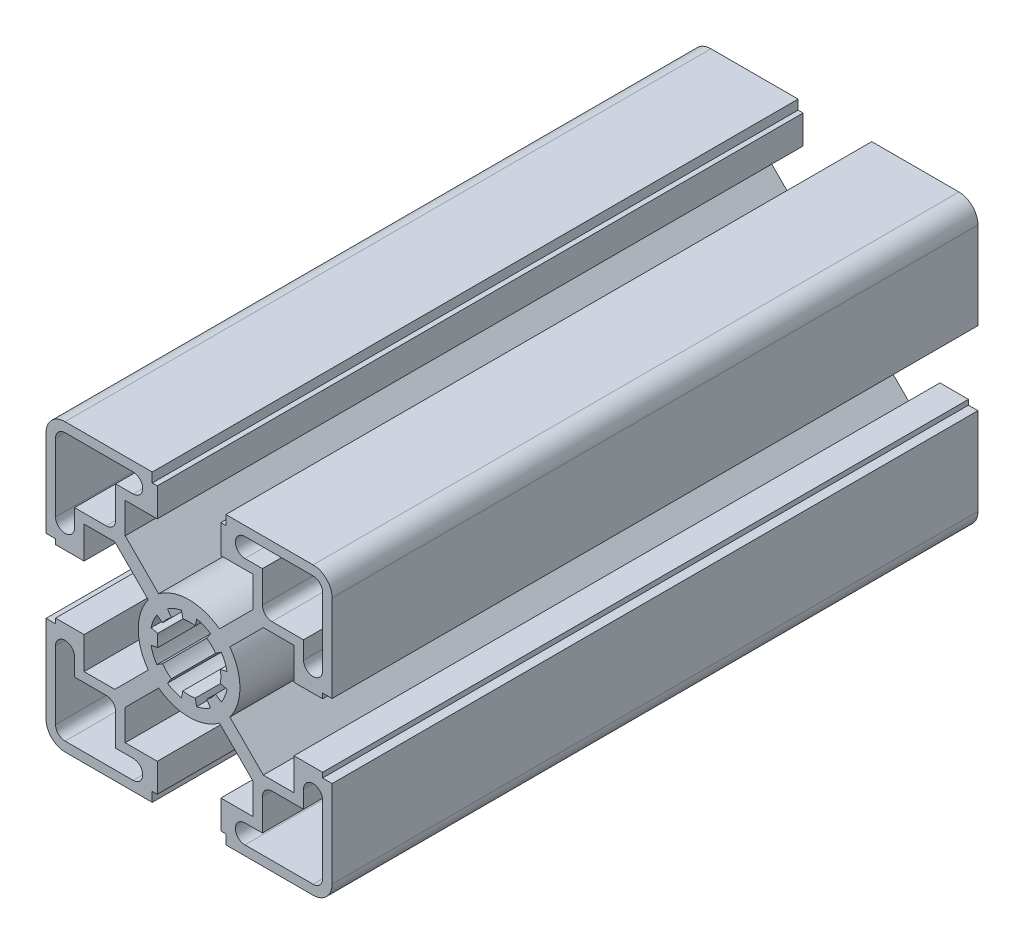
from build123d import *

# Parameters (mm, degrees)
BOSS_EXTRUDE1_DEPTH = 50.8


with BuildPart() as part:
    # Sketch1 → Boss-Extrude1 (new, symmetric)
    with BuildSketch(Plane.XY):
        with BuildLine():
            Line((-19.5072, 22.5044), (-5.7912, 22.5044))
            Line((-5.7912, 22.5044), (-5.7912, 21.0058))
            Line((-5.7912, 21.0058), (-5.0038, 21.0058))
            Line((-5.0038, 21.0058), (-5.0038, 16.51))
            Line((-5.0038, 16.51), (-10.0457, 16.51))
            Line((-10.0457, 16.51), (-10.0457, 11.680106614))
            Line((-10.0457, 11.680106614), (-4.781026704, 6.415433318))
            ThreePointArc((-4.781026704, 6.415433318), (0, 8.001), (4.781026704, 6.415433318))
            Line((4.781026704, 6.415433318), (10.0457, 11.680106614))
            Line((10.0457, 11.680106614), (10.0457, 16.51))
            Line((10.0457, 16.51), (5.0038, 16.51))
            Line((5.0038, 16.51), (5.0038, 21.0058))
            Line((5.0038, 21.0058), (5.7912, 21.0058))
            Line((5.7912, 21.0058), (5.7912, 22.5044))
            Line((5.7912, 22.5044), (19.5072, 22.5044))
            ThreePointArc((19.5072, 22.5044), (21.626540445, 21.626540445), (22.5044, 19.5072))
            Line((22.5044, 19.5072), (22.5044, 5.7912))
            Line((22.5044, 5.7912), (21.0058, 5.7912))
            Line((21.0058, 5.7912), (21.0058, 5.0038))
            Line((21.0058, 5.0038), (16.51, 5.0038))
            Line((16.51, 5.0038), (16.51, 10.0457))
            Line((16.51, 10.0457), (11.680106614, 10.0457))
            Line((11.680106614, 10.0457), (6.415433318, 4.781026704))
            ThreePointArc((6.415433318, 4.781026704), (8.001, 0), (6.415433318, -4.781026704))
            Line((6.415433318, -4.781026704), (11.680106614, -10.0457))
            Line((11.680106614, -10.0457), (16.51, -10.0457))
            Line((16.51, -10.0457), (16.51, -5.0038))
            Line((16.51, -5.0038), (21.0058, -5.0038))
            Line((21.0058, -5.0038), (21.0058, -5.7912))
            Line((21.0058, -5.7912), (22.5044, -5.7912))
            Line((22.5044, -5.7912), (22.5044, -19.5072))
            ThreePointArc((22.5044, -19.5072), (21.626540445, -21.626540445), (19.5072, -22.5044))
            Line((19.5072, -22.5044), (5.7912, -22.5044))
            Line((5.7912, -22.5044), (5.7912, -21.0058))
            Line((5.7912, -21.0058), (5.0038, -21.0058))
            Line((5.0038, -21.0058), (5.0038, -16.51))
            Line((5.0038, -16.51), (10.0457, -16.51))
            Line((10.0457, -16.51), (10.0457, -11.680106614))
            Line((10.0457, -11.680106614), (4.781026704, -6.415433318))
            ThreePointArc((4.781026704, -6.415433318), (0, -8.001), (-4.781026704, -6.415433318))
            Line((-4.781026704, -6.415433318), (-10.0457, -11.680106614))
            Line((-10.0457, -11.680106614), (-10.0457, -16.51))
            Line((-10.0457, -16.51), (-5.0038, -16.51))
            Line((-5.0038, -16.51), (-5.0038, -21.0058))
            Line((-5.0038, -21.0058), (-5.7912, -21.0058))
            Line((-5.7912, -21.0058), (-5.7912, -22.5044))
            Line((-5.7912, -22.5044), (-19.5072, -22.5044))
            ThreePointArc((-19.5072, -22.5044), (-21.626540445, -21.626540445), (-22.5044, -19.5072))
            Line((-22.5044, -19.5072), (-22.5044, -5.7912))
            Line((-22.5044, -5.7912), (-21.0058, -5.7912))
            Line((-21.0058, -5.7912), (-21.0058, -5.0038))
            Line((-21.0058, -5.0038), (-16.51, -5.0038))
            Line((-16.51, -5.0038), (-16.51, -10.0457))
            Line((-16.51, -10.0457), (-11.680106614, -10.0457))
            Line((-11.680106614, -10.0457), (-6.415433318, -4.781026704))
            ThreePointArc((-6.415433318, -4.781026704), (-8.001, 0), (-6.415433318, 4.781026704))
            Line((-6.415433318, 4.781026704), (-11.680106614, 10.0457))
            Line((-11.680106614, 10.0457), (-16.51, 10.0457))
            Line((-16.51, 10.0457), (-16.51, 5.0038))
            Line((-16.51, 5.0038), (-21.0058, 5.0038))
            Line((-21.0058, 5.0038), (-21.0058, 5.7912))
            Line((-21.0058, 5.7912), (-22.5044, 5.7912))
            Line((-22.5044, 5.7912), (-22.5044, 19.5072))
            ThreePointArc((-22.5044, 19.5072), (-21.626540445, 21.626540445), (-19.5072, 22.5044))
        make_face()
        with BuildLine():
            Line((-18.0086, 11.5443), (-13.0429, 11.5443))
            ThreePointArc((-13.0429, 11.5443), (-11.983229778, 11.983229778), (-11.5443, 13.0429))
            Line((-11.5443, 13.0429), (-11.5443, 18.0086))
            Line((-11.5443, 18.0086), (-8.7884, 18.0086))
            ThreePointArc((-8.7884, 18.0086), (-7.2898, 19.5072), (-8.7884, 21.0058))
            Line((-8.7884, 21.0058), (-19.5072, 21.0058))
            ThreePointArc((-19.5072, 21.0058), (-20.566870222, 20.566870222), (-21.0058, 19.5072))
            Line((-21.0058, 19.5072), (-21.0058, 8.7884))
            ThreePointArc((-21.0058, 8.7884), (-19.5072, 7.2898), (-18.0086, 8.7884))
            Line((-18.0086, 8.7884), (-18.0086, 11.5443))
        make_face(mode=Mode.SUBTRACT)
        with BuildLine():
            Line((1.189270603, 5.978867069), (0.976192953, 4.907653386))
            ThreePointArc((0.976192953, 4.907653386), (0, 5.0038), (-0.976192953, 4.907653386))
            Line((-0.976192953, 4.907653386), (-1.189270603, 5.978867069))
            ThreePointArc((-1.189270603, 5.978867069), (-2.332838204, 5.63196963), (-3.38675614, 5.068638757))
            Line((-3.38675614, 5.068638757), (-2.779962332, 4.160507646))
            ThreePointArc((-2.779962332, 4.160507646), (-3.538220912, 3.538220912), (-4.160507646, 2.779962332))
            Line((-4.160507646, 2.779962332), (-5.068638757, 3.38675614))
            ThreePointArc((-5.068638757, 3.38675614), (-5.63196963, 2.332838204), (-5.978867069, 1.189270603))
            Line((-5.978867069, 1.189270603), (-4.907653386, 0.976192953))
            ThreePointArc((-4.907653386, 0.976192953), (-5.0038, 0), (-4.907653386, -0.976192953))
            Line((-4.907653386, -0.976192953), (-5.978867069, -1.189270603))
            ThreePointArc((-5.978867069, -1.189270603), (-5.63196963, -2.332838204), (-5.068638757, -3.38675614))
            Line((-5.068638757, -3.38675614), (-4.160507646, -2.779962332))
            ThreePointArc((-4.160507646, -2.779962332), (-3.538220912, -3.538220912), (-2.779962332, -4.160507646))
            Line((-2.779962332, -4.160507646), (-3.38675614, -5.068638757))
            ThreePointArc((-3.38675614, -5.068638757), (-2.332838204, -5.63196963), (-1.189270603, -5.978867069))
            Line((-1.189270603, -5.978867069), (-0.976192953, -4.907653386))
            ThreePointArc((-0.976192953, -4.907653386), (0, -5.0038), (0.976192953, -4.907653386))
            Line((0.976192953, -4.907653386), (1.189270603, -5.978867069))
            ThreePointArc((1.189270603, -5.978867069), (2.332838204, -5.63196963), (3.38675614, -5.068638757))
            Line((3.38675614, -5.068638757), (2.779962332, -4.160507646))
            ThreePointArc((2.779962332, -4.160507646), (3.538220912, -3.538220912), (4.160507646, -2.779962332))
            Line((4.160507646, -2.779962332), (5.068638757, -3.38675614))
            ThreePointArc((5.068638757, -3.38675614), (5.63196963, -2.332838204), (5.978867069, -1.189270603))
            Line((5.978867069, -1.189270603), (4.907653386, -0.976192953))
            ThreePointArc((4.907653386, -0.976192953), (5.0038, 0), (4.907653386, 0.976192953))
            Line((4.907653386, 0.976192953), (5.978867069, 1.189270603))
            ThreePointArc((5.978867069, 1.189270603), (5.63196963, 2.332838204), (5.068638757, 3.38675614))
            Line((5.068638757, 3.38675614), (4.160507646, 2.779962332))
            ThreePointArc((4.160507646, 2.779962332), (3.538220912, 3.538220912), (2.779962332, 4.160507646))
            Line((2.779962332, 4.160507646), (3.38675614, 5.068638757))
            ThreePointArc((3.38675614, 5.068638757), (2.332838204, 5.63196963), (1.189270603, 5.978867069))
        make_face(mode=Mode.SUBTRACT)
        with BuildLine():
            Line((11.5443, 18.0086), (8.7884, 18.0086))
            ThreePointArc((8.7884, 18.0086), (7.2898, 19.5072), (8.7884, 21.0058))
            Line((8.7884, 21.0058), (19.5072, 21.0058))
            ThreePointArc((19.5072, 21.0058), (20.566870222, 20.566870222), (21.0058, 19.5072))
            Line((21.0058, 19.5072), (21.0058, 8.7884))
            ThreePointArc((21.0058, 8.7884), (19.5072, 7.2898), (18.0086, 8.7884))
            Line((18.0086, 8.7884), (18.0086, 11.5443))
            Line((18.0086, 11.5443), (13.0429, 11.5443))
            ThreePointArc((13.0429, 11.5443), (11.983229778, 11.983229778), (11.5443, 13.0429))
            Line((11.5443, 13.0429), (11.5443, 18.0086))
        make_face(mode=Mode.SUBTRACT)
        with BuildLine():
            Line((18.0086, -11.5443), (13.0429, -11.5443))
            ThreePointArc((13.0429, -11.5443), (11.983229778, -11.983229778), (11.5443, -13.0429))
            Line((11.5443, -13.0429), (11.5443, -18.0086))
            Line((11.5443, -18.0086), (8.7884, -18.0086))
            ThreePointArc((8.7884, -18.0086), (7.2898, -19.5072), (8.7884, -21.0058))
            Line((8.7884, -21.0058), (19.5072, -21.0058))
            ThreePointArc((19.5072, -21.0058), (20.566870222, -20.566870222), (21.0058, -19.5072))
            Line((21.0058, -19.5072), (21.0058, -8.7884))
            ThreePointArc((21.0058, -8.7884), (19.5072, -7.2898), (18.0086, -8.7884))
            Line((18.0086, -8.7884), (18.0086, -11.5443))
        make_face(mode=Mode.SUBTRACT)
        with BuildLine():
            Line((-11.5443, -18.0086), (-8.7884, -18.0086))
            ThreePointArc((-8.7884, -18.0086), (-7.2898, -19.5072), (-8.7884, -21.0058))
            Line((-8.7884, -21.0058), (-19.5072, -21.0058))
            ThreePointArc((-19.5072, -21.0058), (-20.566870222, -20.566870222), (-21.0058, -19.5072))
            Line((-21.0058, -19.5072), (-21.0058, -8.7884))
            ThreePointArc((-21.0058, -8.7884), (-19.5072, -7.2898), (-18.0086, -8.7884))
            Line((-18.0086, -8.7884), (-18.0086, -11.5443))
            Line((-18.0086, -11.5443), (-13.0429, -11.5443))
            ThreePointArc((-13.0429, -11.5443), (-11.983229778, -11.983229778), (-11.5443, -13.0429))
            Line((-11.5443, -13.0429), (-11.5443, -18.0086))
        make_face(mode=Mode.SUBTRACT)
    extrude(amount=BOSS_EXTRUDE1_DEPTH, both=True)


solid = part.part
